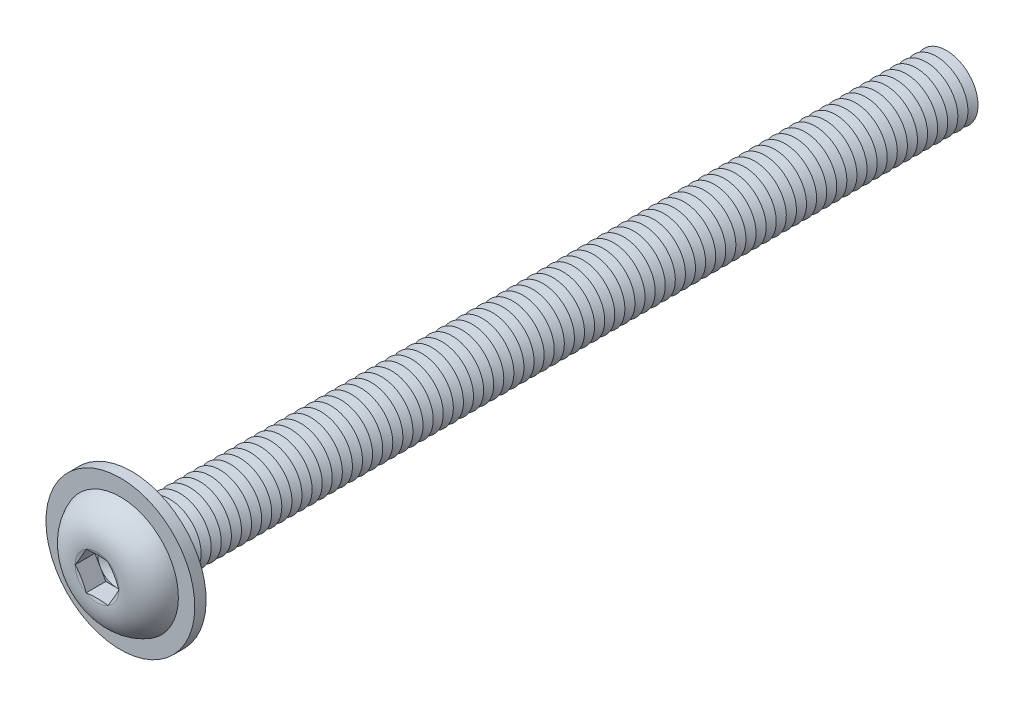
from build123d import *

# Parameters (mm, degrees)
FILLET1_R           = 0.4
LPATTERN1_COUNT     = 81
LPATTERN1_PITCH     = 0.8
CUT_EXTRUDE1_DEPTH  = 1.56
SKETCH5_R           = 5.9
SKETCH5_R_2         = 2.9
BOSS_EXTRUDE1_DEPTH = 0.9


with BuildPart() as part:
    # Sketch1 → Revolve1 (revolve)
    with BuildSketch(Plane(origin=(0, 0, 0), x_dir=(0, 0, -1), z_dir=(1, 0, 0))):
        with BuildLine():
            Line((0, 2.5), (0, 4.75))
            ThreePointArc((0, 4.75), (-2.041477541, 3.848329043), (-2.75, 1.73205))
            Line((-2.75, 1.73205), (-2.517949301, 0.866025))
            Line((-2.517949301, 0.866025), (-2.75, 0.866025))
            Line((-2.75, 0.866025), (-2.75, 0))
            Line((-2.75, 0), (65, 0))
            Line((65, 0), (65, 2.5))
            Line((65, 2.5), (0, 2.5))
        make_face()
    revolve(axis=Axis((0, 0, -65), (0, 0, 1)))

    # Fillet1
    fillet1_edges = [part.edges().sort_by_distance(p)[0] for p in [
        (0, -2.5, 0),
    ]]
    fillet(fillet1_edges, radius=FILLET1_R)

    # Sketch2 → Cut-Revolve1 (revolve, cut)
    with BuildSketch(Plane(origin=(0, 0, 0), x_dir=(0, 0, -1), z_dir=(1, 0, 0))):
        Polygon((64.6, 2.5), (65.4, 2.5), (65, 1.807179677), align=None)
    cut_revolve1 = revolve(axis=Axis((0, 0, -65), (0, 0, -1)), mode=Mode.SUBTRACT)

    # LPattern1: Cut-Revolve1 ×81
    with Locations(*[(0, 0, i * LPATTERN1_PITCH) for i in range(1, LPATTERN1_COUNT)]):
        add(cut_revolve1, mode=Mode.SUBTRACT)

    # Sketch3 → Cut-Extrude1 (cut)
    with BuildSketch(Plane.XY.offset(2.75)):
        Polygon((0.866025, 1.499999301), (-0.866025, 1.499999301), (-1.73205, 0), (-0.866025, -1.499999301), (0.866025, -1.499999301), (1.73205, 0), align=None)
    extrude(amount=-CUT_EXTRUDE1_DEPTH, mode=Mode.SUBTRACT)

    # Cut-Extrude2 cone 1 section (on through the dimple's axis) → Cut-Extrude2 (revolve, cut)
    with BuildSketch(Plane(origin=(0, 0, 1.19), x_dir=(0, -1, 0), z_dir=(1, 0, 0))):
        Polygon((0, 0), (1.499999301, 0), (0, 0.866025), align=None)
    revolve(axis=Axis((0, 0, 1.19), (0, 0, -1)), mode=Mode.SUBTRACT)

    # Sketch5 → Boss-Extrude1 (add)
    with BuildSketch(Plane(origin=(0, 0, 0), x_dir=(-1, 0, 0), z_dir=(0, 0, -1))):
        with Locations(Location((0, 0, 0), (0, 0, 90))):
            Circle(SKETCH5_R)
        Circle(SKETCH5_R_2, mode=Mode.SUBTRACT)
    extrude(amount=-BOSS_EXTRUDE1_DEPTH)


solid = part.part
